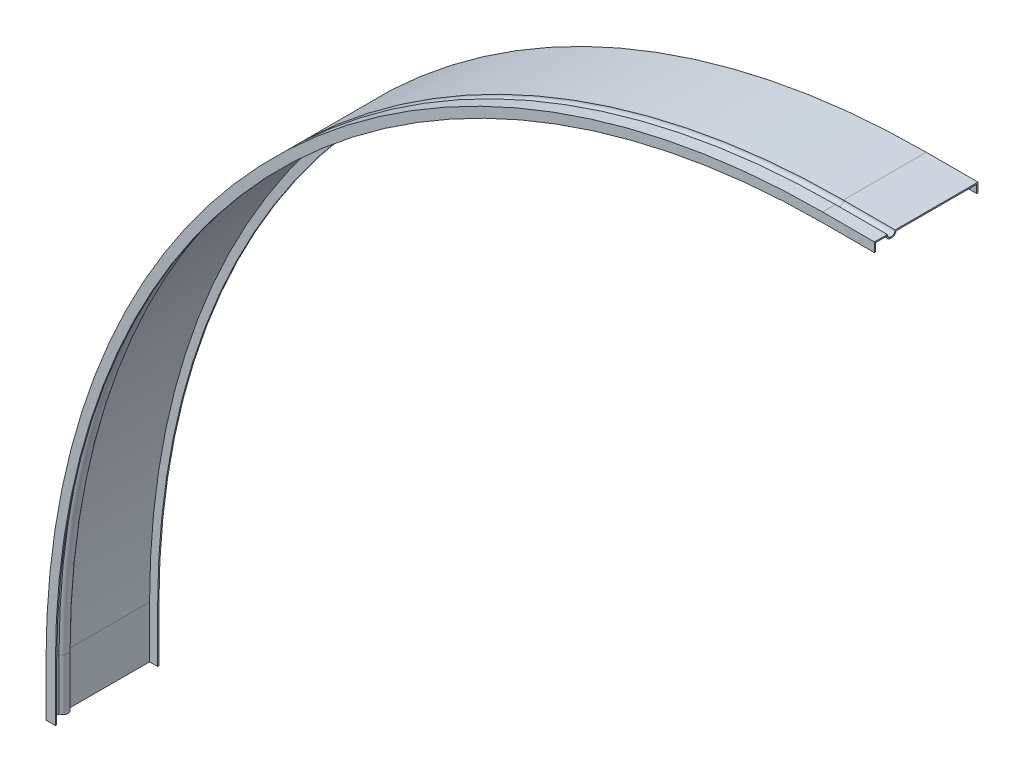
ISO-10303-21;
HEADER;
FILE_DESCRIPTION(('STEP AP214'),'2;1');
FILE_NAME('part.step','',(''),(''),'','','');
FILE_SCHEMA(('AUTOMOTIVE_DESIGN { 1 0 10303 214 1 1 1 1 }'));
ENDSEC;
DATA;
#1=APPLICATION_CONTEXT('core data for automotive mechanical design processes');
#2=APPLICATION_PROTOCOL_DEFINITION('international standard','automotive_design',2000,#1);
#3=PRODUCT_CONTEXT('',#1,'mechanical');
#4=PRODUCT('Part','Part','',(#3));
#5=PRODUCT_RELATED_PRODUCT_CATEGORY('part','',(#4));
#6=PRODUCT_DEFINITION_FORMATION('','',#4);
#7=PRODUCT_DEFINITION_CONTEXT('part definition',#1,'design');
#8=PRODUCT_DEFINITION('design','',#6,#7);
#9=PRODUCT_DEFINITION_SHAPE('','',#8);
#10=(LENGTH_UNIT() NAMED_UNIT(*) SI_UNIT(.MILLI.,.METRE.));
#11=(NAMED_UNIT(*) PLANE_ANGLE_UNIT() SI_UNIT($,.RADIAN.));
#12=(NAMED_UNIT(*) SI_UNIT($,.STERADIAN.) SOLID_ANGLE_UNIT());
#13=UNCERTAINTY_MEASURE_WITH_UNIT(LENGTH_MEASURE(1.E-05),#10,'distance_accuracy_value','');
#14=(GEOMETRIC_REPRESENTATION_CONTEXT(3) GLOBAL_UNCERTAINTY_ASSIGNED_CONTEXT((#13)) GLOBAL_UNIT_ASSIGNED_CONTEXT((#10,
#11,#12)) REPRESENTATION_CONTEXT('',''));
#15=CARTESIAN_POINT('',(0.,0.,0.));
#16=DIRECTION('',(0.,0.,1.));
#17=DIRECTION('',(1.,0.,0.));
#18=AXIS2_PLACEMENT_3D('',#15,#16,#17);
#19=CARTESIAN_POINT('',(750.,800.,83.786));
#20=DIRECTION('',(1.,0.,0.));
#21=DIRECTION('',(0.,1.,0.));
#22=AXIS2_PLACEMENT_3D('',#19,#20,#21);
#23=CYLINDRICAL_SURFACE('',#22,3.786);
#24=CARTESIAN_POINT('',(750.,800.,83.786));
#25=DIRECTION('',(-1.,0.,0.));
#26=DIRECTION('',(0.,0.,-1.));
#27=AXIS2_PLACEMENT_3D('',#24,#25,#26);
#28=CIRCLE('',#27,3.786);
#29=CARTESIAN_POINT('',(750.,800.,80.));
#30=VERTEX_POINT('',#29);
#31=CARTESIAN_POINT('',(750.,800.,87.572));
#32=VERTEX_POINT('',#31);
#33=EDGE_CURVE('E201',#30,#32,#28,.T.);
#34=ORIENTED_EDGE('',*,*,#33,.T.);
#35=DIRECTION('',(1.,0.,0.));
#36=VECTOR('',#35,1.);
#37=CARTESIAN_POINT('',(750.,800.,87.572));
#38=LINE('',#37,#36);
#39=CARTESIAN_POINT('',(800.,800.,87.572));
#40=VERTEX_POINT('',#39);
#41=EDGE_CURVE('E38',#32,#40,#38,.T.);
#42=ORIENTED_EDGE('',*,*,#41,.T.);
#43=CARTESIAN_POINT('',(800.,800.,83.786));
#44=DIRECTION('',(-1.,0.,0.));
#45=DIRECTION('',(0.,0.,-1.));
#46=AXIS2_PLACEMENT_3D('',#43,#44,#45);
#47=CIRCLE('',#46,3.786);
#48=CARTESIAN_POINT('',(800.,800.,80.));
#49=VERTEX_POINT('',#48);
#50=EDGE_CURVE('E45',#49,#40,#47,.T.);
#51=ORIENTED_EDGE('',*,*,#50,.F.);
#52=DIRECTION('',(1.,0.,0.));
#53=VECTOR('',#52,1.);
#54=CARTESIAN_POINT('',(750.,800.,80.));
#55=LINE('',#54,#53);
#56=EDGE_CURVE('E11',#30,#49,#55,.T.);
#57=ORIENTED_EDGE('',*,*,#56,.F.);
#58=EDGE_LOOP('',(#34,#42,#51,#57));
#59=FACE_BOUND('',#58,.T.);
#60=ADVANCED_FACE('F31',(#59),#23,.F.);
#61=CARTESIAN_POINT('',(750.,800.,87.572));
#62=DIRECTION('',(0.,1.,0.));
#63=DIRECTION('',(-1.,0.,0.));
#64=AXIS2_PLACEMENT_3D('',#61,#62,#63);
#65=PLANE('',#64);
#66=DIRECTION('',(0.,0.,1.));
#67=VECTOR('',#66,1.);
#68=CARTESIAN_POINT('',(750.,800.,87.572));
#69=LINE('',#68,#67);
#70=CARTESIAN_POINT('',(750.,800.,100.));
#71=VERTEX_POINT('',#70);
#72=EDGE_CURVE('E254',#32,#71,#69,.T.);
#73=ORIENTED_EDGE('',*,*,#72,.T.);
#74=DIRECTION('',(1.,0.,0.));
#75=VECTOR('',#74,1.);
#76=CARTESIAN_POINT('',(750.,800.,100.));
#77=LINE('',#76,#75);
#78=CARTESIAN_POINT('',(800.,800.,100.));
#79=VERTEX_POINT('',#78);
#80=EDGE_CURVE('E344',#71,#79,#77,.T.);
#81=ORIENTED_EDGE('',*,*,#80,.T.);
#82=DIRECTION('',(0.,0.,1.));
#83=VECTOR('',#82,1.);
#84=CARTESIAN_POINT('',(800.,800.,87.572));
#85=LINE('',#84,#83);
#86=EDGE_CURVE('E53',#40,#79,#85,.T.);
#87=ORIENTED_EDGE('',*,*,#86,.F.);
#88=ORIENTED_EDGE('',*,*,#41,.F.);
#89=EDGE_LOOP('',(#73,#81,#87,#88));
#90=FACE_BOUND('',#89,.T.);
#91=ADVANCED_FACE('F346',(#90),#65,.T.);
#92=CARTESIAN_POINT('',(750.,791.,100.));
#93=DIRECTION('',(0.,-1.,0.));
#94=DIRECTION('',(1.,0.,0.));
#95=AXIS2_PLACEMENT_3D('',#92,#93,#94);
#96=PLANE('',#95);
#97=DIRECTION('',(0.,0.,-1.));
#98=VECTOR('',#97,1.);
#99=CARTESIAN_POINT('',(750.,791.,100.));
#100=LINE('',#99,#98);
#101=CARTESIAN_POINT('',(750.,791.,100.));
#102=VERTEX_POINT('',#101);
#103=CARTESIAN_POINT('',(750.,791.,98.786));
#104=VERTEX_POINT('',#103);
#105=EDGE_CURVE('E251',#102,#104,#100,.T.);
#106=ORIENTED_EDGE('',*,*,#105,.T.);
#107=DIRECTION('',(1.,0.,0.));
#108=VECTOR('',#107,1.);
#109=CARTESIAN_POINT('',(750.,791.,98.786));
#110=LINE('',#109,#108);
#111=CARTESIAN_POINT('',(800.,791.,98.786));
#112=VERTEX_POINT('',#111);
#113=EDGE_CURVE('E338',#104,#112,#110,.T.);
#114=ORIENTED_EDGE('',*,*,#113,.T.);
#115=DIRECTION('',(0.,0.,-1.));
#116=VECTOR('',#115,1.);
#117=CARTESIAN_POINT('',(800.,791.,100.));
#118=LINE('',#117,#116);
#119=CARTESIAN_POINT('',(800.,791.,100.));
#120=VERTEX_POINT('',#119);
#121=EDGE_CURVE('E309',#120,#112,#118,.T.);
#122=ORIENTED_EDGE('',*,*,#121,.F.);
#123=DIRECTION('',(1.,0.,0.));
#124=VECTOR('',#123,1.);
#125=CARTESIAN_POINT('',(750.,791.,100.));
#126=LINE('',#125,#124);
#127=EDGE_CURVE('E341',#102,#120,#126,.T.);
#128=ORIENTED_EDGE('',*,*,#127,.F.);
#129=EDGE_LOOP('',(#106,#114,#122,#128));
#130=FACE_BOUND('',#129,.T.);
#131=ADVANCED_FACE('F472',(#130),#96,.T.);
#132=CARTESIAN_POINT('',(750.,798.786,98.786));
#133=DIRECTION('',(0.,-1.,0.));
#134=DIRECTION('',(1.,0.,0.));
#135=AXIS2_PLACEMENT_3D('',#132,#133,#134);
#136=PLANE('',#135);
#137=DIRECTION('',(0.,0.,-1.));
#138=VECTOR('',#137,1.);
#139=CARTESIAN_POINT('',(750.,798.786,98.786));
#140=LINE('',#139,#138);
#141=CARTESIAN_POINT('',(750.,798.786,98.786));
#142=VERTEX_POINT('',#141);
#143=CARTESIAN_POINT('',(750.,798.786,88.6363818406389));
#144=VERTEX_POINT('',#143);
#145=EDGE_CURVE('E248',#142,#144,#140,.T.);
#146=ORIENTED_EDGE('',*,*,#145,.T.);
#147=DIRECTION('',(1.,0.,0.));
#148=VECTOR('',#147,1.);
#149=CARTESIAN_POINT('',(750.,798.786,88.6363818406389));
#150=LINE('',#149,#148);
#151=CARTESIAN_POINT('',(800.,798.786,88.6363818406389));
#152=VERTEX_POINT('',#151);
#153=EDGE_CURVE('E332',#144,#152,#150,.T.);
#154=ORIENTED_EDGE('',*,*,#153,.T.);
#155=DIRECTION('',(0.,0.,-1.));
#156=VECTOR('',#155,1.);
#157=CARTESIAN_POINT('',(800.,798.786,98.786));
#158=LINE('',#157,#156);
#159=CARTESIAN_POINT('',(800.,798.786,98.786));
#160=VERTEX_POINT('',#159);
#161=EDGE_CURVE('E303',#160,#152,#158,.T.);
#162=ORIENTED_EDGE('',*,*,#161,.F.);
#163=DIRECTION('',(1.,0.,0.));
#164=VECTOR('',#163,1.);
#165=CARTESIAN_POINT('',(750.,798.786,98.786));
#166=LINE('',#165,#164);
#167=EDGE_CURVE('E335',#142,#160,#166,.T.);
#168=ORIENTED_EDGE('',*,*,#167,.F.);
#169=EDGE_LOOP('',(#146,#154,#162,#168));
#170=FACE_BOUND('',#169,.T.);
#171=ADVANCED_FACE('F475',(#170),#136,.T.);
#172=CARTESIAN_POINT('',(750.,800.,83.786));
#173=DIRECTION('',(1.,0.,0.));
#174=DIRECTION('',(0.,1.,0.));
#175=AXIS2_PLACEMENT_3D('',#172,#173,#174);
#176=CYLINDRICAL_SURFACE('',#175,4.99999999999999);
#177=CARTESIAN_POINT('',(750.,800.,83.786));
#178=DIRECTION('',(1.,0.,0.));
#179=DIRECTION('',(0.,0.,1.));
#180=AXIS2_PLACEMENT_3D('',#177,#178,#179);
#181=CIRCLE('',#180,4.99999999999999);
#182=CARTESIAN_POINT('',(750.,798.786,78.9356181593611));
#183=VERTEX_POINT('',#182);
#184=EDGE_CURVE('E245',#144,#183,#181,.T.);
#185=ORIENTED_EDGE('',*,*,#184,.T.);
#186=DIRECTION('',(1.,0.,0.));
#187=VECTOR('',#186,1.);
#188=CARTESIAN_POINT('',(750.,798.786,78.9356181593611));
#189=LINE('',#188,#187);
#190=CARTESIAN_POINT('',(800.,798.786,78.9356181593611));
#191=VERTEX_POINT('',#190);
#192=EDGE_CURVE('E329',#183,#191,#189,.T.);
#193=ORIENTED_EDGE('',*,*,#192,.T.);
#194=CARTESIAN_POINT('',(800.,800.,83.786));
#195=DIRECTION('',(1.,0.,0.));
#196=DIRECTION('',(0.,0.,1.));
#197=AXIS2_PLACEMENT_3D('',#194,#195,#196);
#198=CIRCLE('',#197,4.99999999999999);
#199=EDGE_CURVE('E300',#152,#191,#198,.T.);
#200=ORIENTED_EDGE('',*,*,#199,.F.);
#201=ORIENTED_EDGE('',*,*,#153,.F.);
#202=EDGE_LOOP('',(#185,#193,#200,#201));
#203=FACE_BOUND('',#202,.T.);
#204=ADVANCED_FACE('F482',(#203),#176,.T.);
#205=CARTESIAN_POINT('',(750.,798.786,78.9356181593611));
#206=DIRECTION('',(0.,-1.,0.));
#207=DIRECTION('',(1.,0.,0.));
#208=AXIS2_PLACEMENT_3D('',#205,#206,#207);
#209=PLANE('',#208);
#210=DIRECTION('',(0.,0.,-1.));
#211=VECTOR('',#210,1.);
#212=CARTESIAN_POINT('',(750.,798.786,78.9356181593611));
#213=LINE('',#212,#211);
#214=CARTESIAN_POINT('',(750.,798.786,1.214));
#215=VERTEX_POINT('',#214);
#216=EDGE_CURVE('E242',#183,#215,#213,.T.);
#217=ORIENTED_EDGE('',*,*,#216,.T.);
#218=DIRECTION('',(1.,0.,0.));
#219=VECTOR('',#218,1.);
#220=CARTESIAN_POINT('',(750.,798.786,1.214));
#221=LINE('',#220,#219);
#222=CARTESIAN_POINT('',(800.,798.786,1.214));
#223=VERTEX_POINT('',#222);
#224=EDGE_CURVE('E326',#215,#223,#221,.T.);
#225=ORIENTED_EDGE('',*,*,#224,.T.);
#226=DIRECTION('',(0.,0.,-1.));
#227=VECTOR('',#226,1.);
#228=CARTESIAN_POINT('',(800.,798.786,78.9356181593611));
#229=LINE('',#228,#227);
#230=EDGE_CURVE('E297',#191,#223,#229,.T.);
#231=ORIENTED_EDGE('',*,*,#230,.F.);
#232=ORIENTED_EDGE('',*,*,#192,.F.);
#233=EDGE_LOOP('',(#217,#225,#231,#232));
#234=FACE_BOUND('',#233,.T.);
#235=ADVANCED_FACE('F484',(#234),#209,.T.);
#236=CARTESIAN_POINT('',(750.,791.,1.214));
#237=DIRECTION('',(0.,-1.,0.));
#238=DIRECTION('',(1.,0.,0.));
#239=AXIS2_PLACEMENT_3D('',#236,#237,#238);
#240=PLANE('',#239);
#241=DIRECTION('',(0.,0.,-1.));
#242=VECTOR('',#241,1.);
#243=CARTESIAN_POINT('',(750.,791.,1.214));
#244=LINE('',#243,#242);
#245=CARTESIAN_POINT('',(750.,791.,1.214));
#246=VERTEX_POINT('',#245);
#247=CARTESIAN_POINT('',(750.,791.,0.));
#248=VERTEX_POINT('',#247);
#249=EDGE_CURVE('E234',#246,#248,#244,.T.);
#250=ORIENTED_EDGE('',*,*,#249,.T.);
#251=DIRECTION('',(1.,0.,0.));
#252=VECTOR('',#251,1.);
#253=CARTESIAN_POINT('',(750.,791.,0.));
#254=LINE('',#253,#252);
#255=CARTESIAN_POINT('',(800.,791.,0.));
#256=VERTEX_POINT('',#255);
#257=EDGE_CURVE('E320',#248,#256,#254,.T.);
#258=ORIENTED_EDGE('',*,*,#257,.T.);
#259=DIRECTION('',(0.,0.,-1.));
#260=VECTOR('',#259,1.);
#261=CARTESIAN_POINT('',(800.,791.,1.214));
#262=LINE('',#261,#260);
#263=CARTESIAN_POINT('',(800.,791.,1.214));
#264=VERTEX_POINT('',#263);
#265=EDGE_CURVE('E291',#264,#256,#262,.T.);
#266=ORIENTED_EDGE('',*,*,#265,.F.);
#267=DIRECTION('',(1.,0.,0.));
#268=VECTOR('',#267,1.);
#269=CARTESIAN_POINT('',(750.,791.,1.214));
#270=LINE('',#269,#268);
#271=EDGE_CURVE('E323',#246,#264,#270,.T.);
#272=ORIENTED_EDGE('',*,*,#271,.F.);
#273=EDGE_LOOP('',(#250,#258,#266,#272));
#274=FACE_BOUND('',#273,.T.);
#275=ADVANCED_FACE('F487',(#274),#240,.T.);
#276=CARTESIAN_POINT('',(750.,800.,0.));
#277=DIRECTION('',(0.,1.,0.));
#278=DIRECTION('',(-1.,0.,0.));
#279=AXIS2_PLACEMENT_3D('',#276,#277,#278);
#280=PLANE('',#279);
#281=DIRECTION('',(0.,0.,1.));
#282=VECTOR('',#281,1.);
#283=CARTESIAN_POINT('',(750.,800.,0.));
#284=LINE('',#283,#282);
#285=CARTESIAN_POINT('',(750.,800.,0.));
#286=VERTEX_POINT('',#285);
#287=EDGE_CURVE('E231',#286,#30,#284,.T.);
#288=ORIENTED_EDGE('',*,*,#287,.T.);
#289=ORIENTED_EDGE('',*,*,#56,.T.);
#290=DIRECTION('',(0.,0.,1.));
#291=VECTOR('',#290,1.);
#292=CARTESIAN_POINT('',(800.,800.,0.));
#293=LINE('',#292,#291);
#294=CARTESIAN_POINT('',(800.,800.,0.));
#295=VERTEX_POINT('',#294);
#296=EDGE_CURVE('E204',#295,#49,#293,.T.);
#297=ORIENTED_EDGE('',*,*,#296,.F.);
#298=DIRECTION('',(1.,0.,0.));
#299=VECTOR('',#298,1.);
#300=CARTESIAN_POINT('',(750.,800.,0.));
#301=LINE('',#300,#299);
#302=EDGE_CURVE('E317',#286,#295,#301,.T.);
#303=ORIENTED_EDGE('',*,*,#302,.F.);
#304=EDGE_LOOP('',(#288,#289,#297,#303));
#305=FACE_BOUND('',#304,.T.);
#306=ADVANCED_FACE('F358',(#305),#280,.T.);
#307=CARTESIAN_POINT('',(750.,50.,83.786));
#308=DIRECTION('',(0.,0.,-1.));
#309=DIRECTION('',(-1.,0.,0.));
#310=AXIS2_PLACEMENT_3D('',#307,#308,#309);
#311=TOROIDAL_SURFACE('',#310,750.,3.786);
#312=CARTESIAN_POINT('',(0.,50.,83.786));
#313=DIRECTION('',(0.,-1.,0.));
#314=DIRECTION('',(0.,0.,-1.));
#315=AXIS2_PLACEMENT_3D('',#312,#313,#314);
#316=CIRCLE('',#315,3.786);
#317=CARTESIAN_POINT('',(0.,50.,80.));
#318=VERTEX_POINT('',#317);
#319=CARTESIAN_POINT('',(0.,50.,87.572));
#320=VERTEX_POINT('',#319);
#321=EDGE_CURVE('E198',#318,#320,#316,.T.);
#322=ORIENTED_EDGE('',*,*,#321,.T.);
#323=CARTESIAN_POINT('',(750.,50.,87.572));
#324=DIRECTION('',(0.,0.,-1.));
#325=DIRECTION('',(-1.,0.,0.));
#326=AXIS2_PLACEMENT_3D('',#323,#324,#325);
#327=CIRCLE('',#326,750.);
#328=EDGE_CURVE('E205',#320,#32,#327,.T.);
#329=ORIENTED_EDGE('',*,*,#328,.T.);
#330=ORIENTED_EDGE('',*,*,#33,.F.);
#331=CARTESIAN_POINT('',(750.,50.,80.));
#332=DIRECTION('',(0.,0.,-1.));
#333=DIRECTION('',(-1.,0.,0.));
#334=AXIS2_PLACEMENT_3D('',#331,#332,#333);
#335=CIRCLE('',#334,750.);
#336=EDGE_CURVE('E193',#318,#30,#335,.T.);
#337=ORIENTED_EDGE('',*,*,#336,.F.);
#338=EDGE_LOOP('',(#322,#329,#330,#337));
#339=FACE_BOUND('',#338,.T.);
#340=ADVANCED_FACE('F195',(#339),#311,.F.);
#341=CARTESIAN_POINT('',(750.,50.,0.));
#342=DIRECTION('',(0.,0.,-1.));
#343=DIRECTION('',(-1.,0.,0.));
#344=AXIS2_PLACEMENT_3D('',#341,#342,#343);
#345=CYLINDRICAL_SURFACE('',#344,750.);
#346=DIRECTION('',(0.,0.,1.));
#347=VECTOR('',#346,1.);
#348=CARTESIAN_POINT('',(0.,50.,87.572));
#349=LINE('',#348,#347);
#350=CARTESIAN_POINT('',(0.,50.,100.));
#351=VERTEX_POINT('',#350);
#352=EDGE_CURVE('E226',#320,#351,#349,.T.);
#353=ORIENTED_EDGE('',*,*,#352,.T.);
#354=CARTESIAN_POINT('',(750.,50.,100.));
#355=DIRECTION('',(0.,0.,-1.));
#356=DIRECTION('',(-1.,0.,0.));
#357=AXIS2_PLACEMENT_3D('',#354,#355,#356);
#358=CIRCLE('',#357,750.);
#359=EDGE_CURVE('E283',#351,#71,#358,.T.);
#360=ORIENTED_EDGE('',*,*,#359,.T.);
#361=ORIENTED_EDGE('',*,*,#72,.F.);
#362=ORIENTED_EDGE('',*,*,#328,.F.);
#363=EDGE_LOOP('',(#353,#360,#361,#362));
#364=FACE_BOUND('',#363,.T.);
#365=ADVANCED_FACE('F349',(#364),#345,.T.);
#366=CARTESIAN_POINT('',(750.,50.,0.));
#367=DIRECTION('',(0.,0.,-1.));
#368=DIRECTION('',(-1.,0.,0.));
#369=AXIS2_PLACEMENT_3D('',#366,#367,#368);
#370=CYLINDRICAL_SURFACE('',#369,741.);
#371=DIRECTION('',(0.,0.,-1.));
#372=VECTOR('',#371,1.);
#373=CARTESIAN_POINT('',(9.00000000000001,50.,100.));
#374=LINE('',#373,#372);
#375=CARTESIAN_POINT('',(9.00000000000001,50.,100.));
#376=VERTEX_POINT('',#375);
#377=CARTESIAN_POINT('',(9.00000000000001,50.,98.786));
#378=VERTEX_POINT('',#377);
#379=EDGE_CURVE('E402',#376,#378,#374,.T.);
#380=ORIENTED_EDGE('',*,*,#379,.T.);
#381=CARTESIAN_POINT('',(750.,50.,98.786));
#382=DIRECTION('',(0.,0.,-1.));
#383=DIRECTION('',(-1.,0.,0.));
#384=AXIS2_PLACEMENT_3D('',#381,#382,#383);
#385=CIRCLE('',#384,741.);
#386=EDGE_CURVE('E277',#378,#104,#385,.T.);
#387=ORIENTED_EDGE('',*,*,#386,.T.);
#388=ORIENTED_EDGE('',*,*,#105,.F.);
#389=CARTESIAN_POINT('',(750.,50.,100.));
#390=DIRECTION('',(0.,0.,-1.));
#391=DIRECTION('',(-1.,0.,0.));
#392=AXIS2_PLACEMENT_3D('',#389,#390,#391);
#393=CIRCLE('',#392,741.);
#394=EDGE_CURVE('E280',#376,#102,#393,.T.);
#395=ORIENTED_EDGE('',*,*,#394,.F.);
#396=EDGE_LOOP('',(#380,#387,#388,#395));
#397=FACE_BOUND('',#396,.T.);
#398=ADVANCED_FACE('F470',(#397),#370,.F.);
#399=CARTESIAN_POINT('',(750.,50.,0.));
#400=DIRECTION('',(0.,0.,-1.));
#401=DIRECTION('',(-1.,0.,0.));
#402=AXIS2_PLACEMENT_3D('',#399,#400,#401);
#403=CYLINDRICAL_SURFACE('',#402,748.786);
#404=DIRECTION('',(0.,0.,-1.));
#405=VECTOR('',#404,1.);
#406=CARTESIAN_POINT('',(1.21400000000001,50.,98.786));
#407=LINE('',#406,#405);
#408=CARTESIAN_POINT('',(1.21400000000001,50.,98.786));
#409=VERTEX_POINT('',#408);
#410=CARTESIAN_POINT('',(1.214,50.,88.6363818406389));
#411=VERTEX_POINT('',#410);
#412=EDGE_CURVE('E438',#409,#411,#407,.T.);
#413=ORIENTED_EDGE('',*,*,#412,.T.);
#414=CARTESIAN_POINT('',(750.,50.,88.6363818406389));
#415=DIRECTION('',(0.,0.,-1.));
#416=DIRECTION('',(-1.,0.,0.));
#417=AXIS2_PLACEMENT_3D('',#414,#415,#416);
#418=CIRCLE('',#417,748.786);
#419=EDGE_CURVE('E271',#411,#144,#418,.T.);
#420=ORIENTED_EDGE('',*,*,#419,.T.);
#421=ORIENTED_EDGE('',*,*,#145,.F.);
#422=CARTESIAN_POINT('',(750.,50.,98.786));
#423=DIRECTION('',(0.,0.,-1.));
#424=DIRECTION('',(-1.,0.,0.));
#425=AXIS2_PLACEMENT_3D('',#422,#423,#424);
#426=CIRCLE('',#425,748.786);
#427=EDGE_CURVE('E274',#409,#142,#426,.T.);
#428=ORIENTED_EDGE('',*,*,#427,.F.);
#429=EDGE_LOOP('',(#413,#420,#421,#428));
#430=FACE_BOUND('',#429,.T.);
#431=ADVANCED_FACE('F478',(#430),#403,.F.);
#432=CARTESIAN_POINT('',(750.,50.,83.786));
#433=DIRECTION('',(0.,0.,-1.));
#434=DIRECTION('',(-1.,0.,0.));
#435=AXIS2_PLACEMENT_3D('',#432,#433,#434);
#436=TOROIDAL_SURFACE('',#435,750.,4.99999999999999);
#437=CARTESIAN_POINT('',(0.,50.,83.786));
#438=DIRECTION('',(0.,1.,0.));
#439=DIRECTION('',(0.,0.,1.));
#440=AXIS2_PLACEMENT_3D('',#437,#438,#439);
#441=CIRCLE('',#440,4.99999999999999);
#442=CARTESIAN_POINT('',(1.214,50.,78.9356181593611));
#443=VERTEX_POINT('',#442);
#444=EDGE_CURVE('E443',#411,#443,#441,.T.);
#445=ORIENTED_EDGE('',*,*,#444,.T.);
#446=CARTESIAN_POINT('',(750.,50.,78.9356181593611));
#447=DIRECTION('',(0.,0.,-1.));
#448=DIRECTION('',(-1.,0.,0.));
#449=AXIS2_PLACEMENT_3D('',#446,#447,#448);
#450=CIRCLE('',#449,748.786);
#451=EDGE_CURVE('E268',#443,#183,#450,.T.);
#452=ORIENTED_EDGE('',*,*,#451,.T.);
#453=ORIENTED_EDGE('',*,*,#184,.F.);
#454=ORIENTED_EDGE('',*,*,#419,.F.);
#455=EDGE_LOOP('',(#445,#452,#453,#454));
#456=FACE_BOUND('',#455,.T.);
#457=ADVANCED_FACE('F480',(#456),#436,.T.);
#458=CARTESIAN_POINT('',(750.,50.,0.));
#459=DIRECTION('',(0.,0.,-1.));
#460=DIRECTION('',(-1.,0.,0.));
#461=AXIS2_PLACEMENT_3D('',#458,#459,#460);
#462=CYLINDRICAL_SURFACE('',#461,748.786);
#463=DIRECTION('',(0.,0.,-1.));
#464=VECTOR('',#463,1.);
#465=CARTESIAN_POINT('',(1.214,50.,78.9356181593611));
#466=LINE('',#465,#464);
#467=CARTESIAN_POINT('',(1.214,50.,1.214));
#468=VERTEX_POINT('',#467);
#469=EDGE_CURVE('E370',#443,#468,#466,.T.);
#470=ORIENTED_EDGE('',*,*,#469,.T.);
#471=CARTESIAN_POINT('',(750.,50.,1.214));
#472=DIRECTION('',(0.,0.,-1.));
#473=DIRECTION('',(-1.,0.,0.));
#474=AXIS2_PLACEMENT_3D('',#471,#472,#473);
#475=CIRCLE('',#474,748.786);
#476=EDGE_CURVE('E265',#468,#215,#475,.T.);
#477=ORIENTED_EDGE('',*,*,#476,.T.);
#478=ORIENTED_EDGE('',*,*,#216,.F.);
#479=ORIENTED_EDGE('',*,*,#451,.F.);
#480=EDGE_LOOP('',(#470,#477,#478,#479));
#481=FACE_BOUND('',#480,.T.);
#482=ADVANCED_FACE('F449',(#481),#462,.F.);
#483=CARTESIAN_POINT('',(750.,50.,0.));
#484=DIRECTION('',(0.,0.,-1.));
#485=DIRECTION('',(-1.,0.,0.));
#486=AXIS2_PLACEMENT_3D('',#483,#484,#485);
#487=CYLINDRICAL_SURFACE('',#486,741.);
#488=DIRECTION('',(0.,0.,-1.));
#489=VECTOR('',#488,1.);
#490=CARTESIAN_POINT('',(9.,50.,1.214));
#491=LINE('',#490,#489);
#492=CARTESIAN_POINT('',(9.,50.,1.214));
#493=VERTEX_POINT('',#492);
#494=CARTESIAN_POINT('',(9.,50.,0.));
#495=VERTEX_POINT('',#494);
#496=EDGE_CURVE('E365',#493,#495,#491,.T.);
#497=ORIENTED_EDGE('',*,*,#496,.T.);
#498=CARTESIAN_POINT('',(750.,50.,0.));
#499=DIRECTION('',(0.,0.,-1.));
#500=DIRECTION('',(-1.,0.,0.));
#501=AXIS2_PLACEMENT_3D('',#498,#499,#500);
#502=CIRCLE('',#501,741.);
#503=EDGE_CURVE('E259',#495,#248,#502,.T.);
#504=ORIENTED_EDGE('',*,*,#503,.T.);
#505=ORIENTED_EDGE('',*,*,#249,.F.);
#506=CARTESIAN_POINT('',(750.,50.,1.214));
#507=DIRECTION('',(0.,0.,-1.));
#508=DIRECTION('',(-1.,0.,0.));
#509=AXIS2_PLACEMENT_3D('',#506,#507,#508);
#510=CIRCLE('',#509,741.);
#511=EDGE_CURVE('E262',#493,#246,#510,.T.);
#512=ORIENTED_EDGE('',*,*,#511,.F.);
#513=EDGE_LOOP('',(#497,#504,#505,#512));
#514=FACE_BOUND('',#513,.T.);
#515=ADVANCED_FACE('F489',(#514),#487,.F.);
#516=CARTESIAN_POINT('',(750.,50.,0.));
#517=DIRECTION('',(0.,0.,-1.));
#518=DIRECTION('',(-1.,0.,0.));
#519=AXIS2_PLACEMENT_3D('',#516,#517,#518);
#520=CYLINDRICAL_SURFACE('',#519,750.);
#521=DIRECTION('',(0.,0.,1.));
#522=VECTOR('',#521,1.);
#523=CARTESIAN_POINT('',(0.,50.,0.));
#524=LINE('',#523,#522);
#525=CARTESIAN_POINT('',(0.,50.,0.));
#526=VERTEX_POINT('',#525);
#527=EDGE_CURVE('E208',#526,#318,#524,.T.);
#528=ORIENTED_EDGE('',*,*,#527,.T.);
#529=ORIENTED_EDGE('',*,*,#336,.T.);
#530=ORIENTED_EDGE('',*,*,#287,.F.);
#531=CARTESIAN_POINT('',(750.,50.,0.));
#532=DIRECTION('',(0.,0.,-1.));
#533=DIRECTION('',(-1.,0.,0.));
#534=AXIS2_PLACEMENT_3D('',#531,#532,#533);
#535=CIRCLE('',#534,750.);
#536=EDGE_CURVE('E211',#526,#286,#535,.T.);
#537=ORIENTED_EDGE('',*,*,#536,.F.);
#538=EDGE_LOOP('',(#528,#529,#530,#537));
#539=FACE_BOUND('',#538,.T.);
#540=ADVANCED_FACE('F209',(#539),#520,.T.);
#541=CARTESIAN_POINT('',(0.,50.,0.));
#542=DIRECTION('',(1.,0.,0.));
#543=DIRECTION('',(0.,0.,-1.));
#544=AXIS2_PLACEMENT_3D('',#541,#542,#543);
#545=PLANE('',#544);
#546=DIRECTION('',(0.,0.,1.));
#547=VECTOR('',#546,1.);
#548=CARTESIAN_POINT('',(0.,0.,0.));
#549=LINE('',#548,#547);
#550=CARTESIAN_POINT('',(0.,0.,0.));
#551=VERTEX_POINT('',#550);
#552=CARTESIAN_POINT('',(0.,0.,80.));
#553=VERTEX_POINT('',#552);
#554=EDGE_CURVE('E230',#551,#553,#549,.T.);
#555=ORIENTED_EDGE('',*,*,#554,.T.);
#556=DIRECTION('',(0.,-1.,0.));
#557=VECTOR('',#556,1.);
#558=CARTESIAN_POINT('',(0.,50.,80.));
#559=LINE('',#558,#557);
#560=EDGE_CURVE('E221',#318,#553,#559,.T.);
#561=ORIENTED_EDGE('',*,*,#560,.F.);
#562=ORIENTED_EDGE('',*,*,#527,.F.);
#563=DIRECTION('',(0.,-1.,0.));
#564=VECTOR('',#563,1.);
#565=CARTESIAN_POINT('',(0.,50.,0.));
#566=LINE('',#565,#564);
#567=EDGE_CURVE('E361',#526,#551,#566,.T.);
#568=ORIENTED_EDGE('',*,*,#567,.T.);
#569=EDGE_LOOP('',(#555,#561,#562,#568));
#570=FACE_BOUND('',#569,.T.);
#571=ADVANCED_FACE('F228',(#570),#545,.F.);
#572=CARTESIAN_POINT('',(0.,50.,83.786));
#573=DIRECTION('',(0.,-1.,0.));
#574=DIRECTION('',(0.,0.,-1.));
#575=AXIS2_PLACEMENT_3D('',#572,#573,#574);
#576=CYLINDRICAL_SURFACE('',#575,3.786);
#577=CARTESIAN_POINT('',(0.,0.,83.786));
#578=DIRECTION('',(0.,-1.,0.));
#579=DIRECTION('',(0.,0.,-1.));
#580=AXIS2_PLACEMENT_3D('',#577,#578,#579);
#581=CIRCLE('',#580,3.786);
#582=CARTESIAN_POINT('',(0.,0.,87.572));
#583=VERTEX_POINT('',#582);
#584=EDGE_CURVE('E431',#553,#583,#581,.T.);
#585=ORIENTED_EDGE('',*,*,#584,.T.);
#586=DIRECTION('',(0.,-1.,0.));
#587=VECTOR('',#586,1.);
#588=CARTESIAN_POINT('',(0.,50.,87.572));
#589=LINE('',#588,#587);
#590=EDGE_CURVE('E224',#320,#583,#589,.T.);
#591=ORIENTED_EDGE('',*,*,#590,.F.);
#592=ORIENTED_EDGE('',*,*,#321,.F.);
#593=ORIENTED_EDGE('',*,*,#560,.T.);
#594=EDGE_LOOP('',(#585,#591,#592,#593));
#595=FACE_BOUND('',#594,.T.);
#596=ADVANCED_FACE('F220',(#595),#576,.F.);
#597=CARTESIAN_POINT('',(0.,50.,87.572));
#598=DIRECTION('',(1.,0.,0.));
#599=DIRECTION('',(0.,0.,-1.));
#600=AXIS2_PLACEMENT_3D('',#597,#598,#599);
#601=PLANE('',#600);
#602=DIRECTION('',(0.,0.,1.));
#603=VECTOR('',#602,1.);
#604=CARTESIAN_POINT('',(0.,0.,87.572));
#605=LINE('',#604,#603);
#606=CARTESIAN_POINT('',(0.,0.,100.));
#607=VERTEX_POINT('',#606);
#608=EDGE_CURVE('E413',#583,#607,#605,.T.);
#609=ORIENTED_EDGE('',*,*,#608,.T.);
#610=DIRECTION('',(0.,-1.,0.));
#611=VECTOR('',#610,1.);
#612=CARTESIAN_POINT('',(0.,50.,100.));
#613=LINE('',#612,#611);
#614=EDGE_CURVE('E236',#351,#607,#613,.T.);
#615=ORIENTED_EDGE('',*,*,#614,.F.);
#616=ORIENTED_EDGE('',*,*,#352,.F.);
#617=ORIENTED_EDGE('',*,*,#590,.T.);
#618=EDGE_LOOP('',(#609,#615,#616,#617));
#619=FACE_BOUND('',#618,.T.);
#620=ADVANCED_FACE('F436',(#619),#601,.F.);
#621=CARTESIAN_POINT('',(0.,50.,100.));
#622=DIRECTION('',(0.,0.,-1.));
#623=DIRECTION('',(-1.,0.,0.));
#624=AXIS2_PLACEMENT_3D('',#621,#622,#623);
#625=PLANE('',#624);
#626=DIRECTION('',(1.,0.,0.));
#627=VECTOR('',#626,1.);
#628=CARTESIAN_POINT('',(0.,0.,100.));
#629=LINE('',#628,#627);
#630=CARTESIAN_POINT('',(9.00000000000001,0.,100.));
#631=VERTEX_POINT('',#630);
#632=EDGE_CURVE('E407',#607,#631,#629,.T.);
#633=ORIENTED_EDGE('',*,*,#632,.T.);
#634=DIRECTION('',(0.,-1.,0.));
#635=VECTOR('',#634,1.);
#636=CARTESIAN_POINT('',(9.00000000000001,50.,100.));
#637=LINE('',#636,#635);
#638=EDGE_CURVE('E392',#376,#631,#637,.T.);
#639=ORIENTED_EDGE('',*,*,#638,.F.);
#640=ORIENTED_EDGE('',*,*,#394,.T.);
#641=ORIENTED_EDGE('',*,*,#127,.T.);
#642=DIRECTION('',(0.,-1.,0.));
#643=VECTOR('',#642,1.);
#644=CARTESIAN_POINT('',(800.,800.,100.));
#645=LINE('',#644,#643);
#646=EDGE_CURVE('E312',#79,#120,#645,.T.);
#647=ORIENTED_EDGE('',*,*,#646,.F.);
#648=ORIENTED_EDGE('',*,*,#80,.F.);
#649=ORIENTED_EDGE('',*,*,#359,.F.);
#650=ORIENTED_EDGE('',*,*,#614,.T.);
#651=EDGE_LOOP('',(#633,#639,#640,#641,#647,#648,#649,#650));
#652=FACE_BOUND('',#651,.T.);
#653=ADVANCED_FACE('F353',(#652),#625,.F.);
#654=CARTESIAN_POINT('',(9.00000000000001,50.,100.));
#655=DIRECTION('',(-1.,0.,0.));
#656=DIRECTION('',(0.,0.,1.));
#657=AXIS2_PLACEMENT_3D('',#654,#655,#656);
#658=PLANE('',#657);
#659=DIRECTION('',(0.,0.,-1.));
#660=VECTOR('',#659,1.);
#661=CARTESIAN_POINT('',(9.00000000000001,0.,100.));
#662=LINE('',#661,#660);
#663=CARTESIAN_POINT('',(9.00000000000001,0.,98.786));
#664=VERTEX_POINT('',#663);
#665=EDGE_CURVE('E400',#631,#664,#662,.T.);
#666=ORIENTED_EDGE('',*,*,#665,.T.);
#667=DIRECTION('',(0.,-1.,0.));
#668=VECTOR('',#667,1.);
#669=CARTESIAN_POINT('',(9.00000000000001,50.,98.786));
#670=LINE('',#669,#668);
#671=EDGE_CURVE('E389',#378,#664,#670,.T.);
#672=ORIENTED_EDGE('',*,*,#671,.F.);
#673=ORIENTED_EDGE('',*,*,#379,.F.);
#674=ORIENTED_EDGE('',*,*,#638,.T.);
#675=EDGE_LOOP('',(#666,#672,#673,#674));
#676=FACE_BOUND('',#675,.T.);
#677=ADVANCED_FACE('F398',(#676),#658,.F.);
#678=CARTESIAN_POINT('',(9.00000000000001,50.,98.786));
#679=DIRECTION('',(0.,0.,1.));
#680=DIRECTION('',(1.,0.,0.));
#681=AXIS2_PLACEMENT_3D('',#678,#679,#680);
#682=PLANE('',#681);
#683=DIRECTION('',(-1.,0.,0.));
#684=VECTOR('',#683,1.);
#685=CARTESIAN_POINT('',(9.00000000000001,0.,98.786));
#686=LINE('',#685,#684);
#687=CARTESIAN_POINT('',(1.21400000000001,0.,98.786));
#688=VERTEX_POINT('',#687);
#689=EDGE_CURVE('E409',#664,#688,#686,.T.);
#690=ORIENTED_EDGE('',*,*,#689,.T.);
#691=DIRECTION('',(0.,-1.,0.));
#692=VECTOR('',#691,1.);
#693=CARTESIAN_POINT('',(1.21400000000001,50.,98.786));
#694=LINE('',#693,#692);
#695=EDGE_CURVE('E386',#409,#688,#694,.T.);
#696=ORIENTED_EDGE('',*,*,#695,.F.);
#697=ORIENTED_EDGE('',*,*,#427,.T.);
#698=ORIENTED_EDGE('',*,*,#167,.T.);
#699=DIRECTION('',(0.,1.,0.));
#700=VECTOR('',#699,1.);
#701=CARTESIAN_POINT('',(800.,791.,98.786));
#702=LINE('',#701,#700);
#703=EDGE_CURVE('E306',#112,#160,#702,.T.);
#704=ORIENTED_EDGE('',*,*,#703,.F.);
#705=ORIENTED_EDGE('',*,*,#113,.F.);
#706=ORIENTED_EDGE('',*,*,#386,.F.);
#707=ORIENTED_EDGE('',*,*,#671,.T.);
#708=EDGE_LOOP('',(#690,#696,#697,#698,#704,#705,#706,#707));
#709=FACE_BOUND('',#708,.T.);
#710=ADVANCED_FACE('F467',(#709),#682,.F.);
#711=CARTESIAN_POINT('',(1.21400000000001,50.,98.786));
#712=DIRECTION('',(-1.,0.,0.));
#713=DIRECTION('',(0.,0.,1.));
#714=AXIS2_PLACEMENT_3D('',#711,#712,#713);
#715=PLANE('',#714);
#716=DIRECTION('',(0.,0.,-1.));
#717=VECTOR('',#716,1.);
#718=CARTESIAN_POINT('',(1.21400000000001,0.,98.786));
#719=LINE('',#718,#717);
#720=CARTESIAN_POINT('',(1.214,0.,88.6363818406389));
#721=VERTEX_POINT('',#720);
#722=EDGE_CURVE('E411',#688,#721,#719,.T.);
#723=ORIENTED_EDGE('',*,*,#722,.T.);
#724=DIRECTION('',(0.,-1.,0.));
#725=VECTOR('',#724,1.);
#726=CARTESIAN_POINT('',(1.214,50.,88.6363818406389));
#727=LINE('',#726,#725);
#728=EDGE_CURVE('E383',#411,#721,#727,.T.);
#729=ORIENTED_EDGE('',*,*,#728,.F.);
#730=ORIENTED_EDGE('',*,*,#412,.F.);
#731=ORIENTED_EDGE('',*,*,#695,.T.);
#732=EDGE_LOOP('',(#723,#729,#730,#731));
#733=FACE_BOUND('',#732,.T.);
#734=ADVANCED_FACE('F464',(#733),#715,.F.);
#735=CARTESIAN_POINT('',(0.,50.,83.786));
#736=DIRECTION('',(0.,-1.,0.));
#737=DIRECTION('',(0.,0.,-1.));
#738=AXIS2_PLACEMENT_3D('',#735,#736,#737);
#739=CYLINDRICAL_SURFACE('',#738,4.99999999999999);
#740=CARTESIAN_POINT('',(0.,0.,83.786));
#741=DIRECTION('',(0.,1.,0.));
#742=DIRECTION('',(0.,0.,1.));
#743=AXIS2_PLACEMENT_3D('',#740,#741,#742);
#744=CIRCLE('',#743,4.99999999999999);
#745=CARTESIAN_POINT('',(1.214,0.,78.9356181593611));
#746=VERTEX_POINT('',#745);
#747=EDGE_CURVE('E418',#721,#746,#744,.T.);
#748=ORIENTED_EDGE('',*,*,#747,.T.);
#749=DIRECTION('',(0.,-1.,0.));
#750=VECTOR('',#749,1.);
#751=CARTESIAN_POINT('',(1.214,50.,78.9356181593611));
#752=LINE('',#751,#750);
#753=EDGE_CURVE('E380',#443,#746,#752,.T.);
#754=ORIENTED_EDGE('',*,*,#753,.F.);
#755=ORIENTED_EDGE('',*,*,#444,.F.);
#756=ORIENTED_EDGE('',*,*,#728,.T.);
#757=EDGE_LOOP('',(#748,#754,#755,#756));
#758=FACE_BOUND('',#757,.T.);
#759=ADVANCED_FACE('F459',(#758),#739,.T.);
#760=CARTESIAN_POINT('',(1.214,50.,78.9356181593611));
#761=DIRECTION('',(-1.,0.,0.));
#762=DIRECTION('',(0.,0.,1.));
#763=AXIS2_PLACEMENT_3D('',#760,#761,#762);
#764=PLANE('',#763);
#765=DIRECTION('',(0.,0.,-1.));
#766=VECTOR('',#765,1.);
#767=CARTESIAN_POINT('',(1.214,0.,78.9356181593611));
#768=LINE('',#767,#766);
#769=CARTESIAN_POINT('',(1.214,0.,1.214));
#770=VERTEX_POINT('',#769);
#771=EDGE_CURVE('E420',#746,#770,#768,.T.);
#772=ORIENTED_EDGE('',*,*,#771,.T.);
#773=DIRECTION('',(0.,-1.,0.));
#774=VECTOR('',#773,1.);
#775=CARTESIAN_POINT('',(1.214,50.,1.214));
#776=LINE('',#775,#774);
#777=EDGE_CURVE('E377',#468,#770,#776,.T.);
#778=ORIENTED_EDGE('',*,*,#777,.F.);
#779=ORIENTED_EDGE('',*,*,#469,.F.);
#780=ORIENTED_EDGE('',*,*,#753,.T.);
#781=EDGE_LOOP('',(#772,#778,#779,#780));
#782=FACE_BOUND('',#781,.T.);
#783=ADVANCED_FACE('F452',(#782),#764,.F.);
#784=CARTESIAN_POINT('',(1.214,50.,1.214));
#785=DIRECTION('',(0.,0.,-1.));
#786=DIRECTION('',(-1.,0.,0.));
#787=AXIS2_PLACEMENT_3D('',#784,#785,#786);
#788=PLANE('',#787);
#789=DIRECTION('',(1.,0.,0.));
#790=VECTOR('',#789,1.);
#791=CARTESIAN_POINT('',(1.214,0.,1.214));
#792=LINE('',#791,#790);
#793=CARTESIAN_POINT('',(9.,0.,1.214));
#794=VERTEX_POINT('',#793);
#795=EDGE_CURVE('E422',#770,#794,#792,.T.);
#796=ORIENTED_EDGE('',*,*,#795,.T.);
#797=DIRECTION('',(0.,-1.,0.));
#798=VECTOR('',#797,1.);
#799=CARTESIAN_POINT('',(9.,50.,1.214));
#800=LINE('',#799,#798);
#801=EDGE_CURVE('E367',#493,#794,#800,.T.);
#802=ORIENTED_EDGE('',*,*,#801,.F.);
#803=ORIENTED_EDGE('',*,*,#511,.T.);
#804=ORIENTED_EDGE('',*,*,#271,.T.);
#805=DIRECTION('',(0.,-1.,0.));
#806=VECTOR('',#805,1.);
#807=CARTESIAN_POINT('',(800.,798.786,1.214));
#808=LINE('',#807,#806);
#809=EDGE_CURVE('E294',#223,#264,#808,.T.);
#810=ORIENTED_EDGE('',*,*,#809,.F.);
#811=ORIENTED_EDGE('',*,*,#224,.F.);
#812=ORIENTED_EDGE('',*,*,#476,.F.);
#813=ORIENTED_EDGE('',*,*,#777,.T.);
#814=EDGE_LOOP('',(#796,#802,#803,#804,#810,#811,#812,#813));
#815=FACE_BOUND('',#814,.T.);
#816=ADVANCED_FACE('F455',(#815),#788,.F.);
#817=CARTESIAN_POINT('',(9.,50.,1.214));
#818=DIRECTION('',(-1.,0.,0.));
#819=DIRECTION('',(0.,0.,1.));
#820=AXIS2_PLACEMENT_3D('',#817,#818,#819);
#821=PLANE('',#820);
#822=DIRECTION('',(0.,0.,-1.));
#823=VECTOR('',#822,1.);
#824=CARTESIAN_POINT('',(9.,0.,1.214));
#825=LINE('',#824,#823);
#826=CARTESIAN_POINT('',(9.,0.,0.));
#827=VERTEX_POINT('',#826);
#828=EDGE_CURVE('E423',#794,#827,#825,.T.);
#829=ORIENTED_EDGE('',*,*,#828,.T.);
#830=DIRECTION('',(0.,-1.,0.));
#831=VECTOR('',#830,1.);
#832=CARTESIAN_POINT('',(9.,50.,0.));
#833=LINE('',#832,#831);
#834=EDGE_CURVE('E364',#495,#827,#833,.T.);
#835=ORIENTED_EDGE('',*,*,#834,.F.);
#836=ORIENTED_EDGE('',*,*,#496,.F.);
#837=ORIENTED_EDGE('',*,*,#801,.T.);
#838=EDGE_LOOP('',(#829,#835,#836,#837));
#839=FACE_BOUND('',#838,.T.);
#840=ADVANCED_FACE('F427',(#839),#821,.F.);
#841=CARTESIAN_POINT('',(0.,50.,0.));
#842=DIRECTION('',(0.,0.,1.));
#843=DIRECTION('',(1.,0.,0.));
#844=AXIS2_PLACEMENT_3D('',#841,#842,#843);
#845=PLANE('',#844);
#846=DIRECTION('',(-1.,0.,0.));
#847=VECTOR('',#846,1.);
#848=CARTESIAN_POINT('',(0.,0.,0.));
#849=LINE('',#848,#847);
#850=EDGE_CURVE('E216',#827,#551,#849,.T.);
#851=ORIENTED_EDGE('',*,*,#850,.T.);
#852=ORIENTED_EDGE('',*,*,#567,.F.);
#853=ORIENTED_EDGE('',*,*,#536,.T.);
#854=ORIENTED_EDGE('',*,*,#302,.T.);
#855=DIRECTION('',(0.,1.,0.));
#856=VECTOR('',#855,1.);
#857=CARTESIAN_POINT('',(800.,800.,0.));
#858=LINE('',#857,#856);
#859=EDGE_CURVE('E288',#256,#295,#858,.T.);
#860=ORIENTED_EDGE('',*,*,#859,.F.);
#861=ORIENTED_EDGE('',*,*,#257,.F.);
#862=ORIENTED_EDGE('',*,*,#503,.F.);
#863=ORIENTED_EDGE('',*,*,#834,.T.);
#864=EDGE_LOOP('',(#851,#852,#853,#854,#860,#861,#862,#863));
#865=FACE_BOUND('',#864,.T.);
#866=ADVANCED_FACE('F360',(#865),#845,.F.);
#867=CARTESIAN_POINT('',(800.,800.,83.786));
#868=DIRECTION('',(-1.,0.,0.));
#869=DIRECTION('',(0.,0.,-1.));
#870=AXIS2_PLACEMENT_3D('',#867,#868,#869);
#871=PLANE('',#870);
#872=ORIENTED_EDGE('',*,*,#296,.T.);
#873=ORIENTED_EDGE('',*,*,#50,.T.);
#874=ORIENTED_EDGE('',*,*,#86,.T.);
#875=ORIENTED_EDGE('',*,*,#646,.T.);
#876=ORIENTED_EDGE('',*,*,#121,.T.);
#877=ORIENTED_EDGE('',*,*,#703,.T.);
#878=ORIENTED_EDGE('',*,*,#161,.T.);
#879=ORIENTED_EDGE('',*,*,#199,.T.);
#880=ORIENTED_EDGE('',*,*,#230,.T.);
#881=ORIENTED_EDGE('',*,*,#809,.T.);
#882=ORIENTED_EDGE('',*,*,#265,.T.);
#883=ORIENTED_EDGE('',*,*,#859,.T.);
#884=EDGE_LOOP('',(#872,#873,#874,#875,#876,#877,#878,#879,#880,#881,#882,#883));
#885=FACE_BOUND('',#884,.T.);
#886=ADVANCED_FACE('F356',(#885),#871,.F.);
#887=CARTESIAN_POINT('',(0.,0.,83.786));
#888=DIRECTION('',(0.,-1.,0.));
#889=DIRECTION('',(0.,0.,-1.));
#890=AXIS2_PLACEMENT_3D('',#887,#888,#889);
#891=PLANE('',#890);
#892=ORIENTED_EDGE('',*,*,#554,.F.);
#893=ORIENTED_EDGE('',*,*,#850,.F.);
#894=ORIENTED_EDGE('',*,*,#828,.F.);
#895=ORIENTED_EDGE('',*,*,#795,.F.);
#896=ORIENTED_EDGE('',*,*,#771,.F.);
#897=ORIENTED_EDGE('',*,*,#747,.F.);
#898=ORIENTED_EDGE('',*,*,#722,.F.);
#899=ORIENTED_EDGE('',*,*,#689,.F.);
#900=ORIENTED_EDGE('',*,*,#665,.F.);
#901=ORIENTED_EDGE('',*,*,#632,.F.);
#902=ORIENTED_EDGE('',*,*,#608,.F.);
#903=ORIENTED_EDGE('',*,*,#584,.F.);
#904=EDGE_LOOP('',(#892,#893,#894,#895,#896,#897,#898,#899,#900,#901,#902,#903));
#905=FACE_BOUND('',#904,.T.);
#906=ADVANCED_FACE('F405',(#905),#891,.T.);
#907=CLOSED_SHELL('',(#60,#91,#131,#171,#204,#235,#275,#306,#340,#365,#398,#431,#457,#482,#515,
#540,#571,#596,#620,#653,#677,#710,#734,#759,#783,#816,#840,#866,#886,#906));
#908=MANIFOLD_SOLID_BREP('B2',#907);
#909=ADVANCED_BREP_SHAPE_REPRESENTATION('',(#18,#908),#14);
#910=SHAPE_DEFINITION_REPRESENTATION(#9,#909);
ENDSEC;
END-ISO-10303-21;
